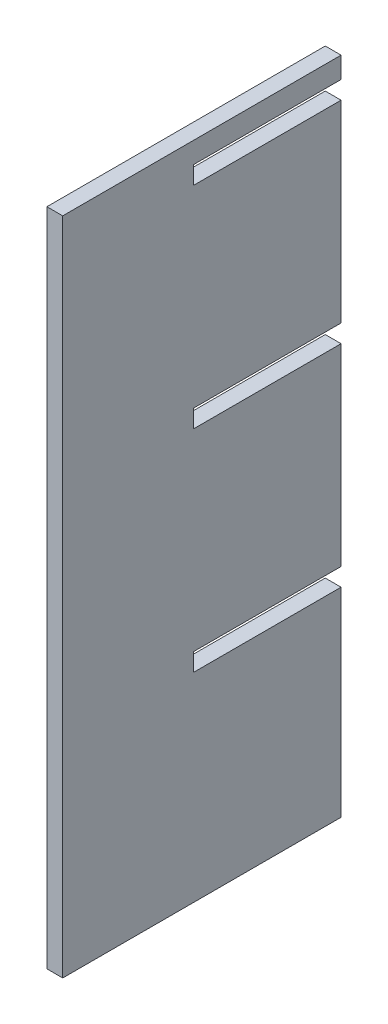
ISO-10303-21;
HEADER;
FILE_DESCRIPTION(('STEP AP214'),'2;1');
FILE_NAME('part.step','',(''),(''),'','','');
FILE_SCHEMA(('AUTOMOTIVE_DESIGN { 1 0 10303 214 1 1 1 1 }'));
ENDSEC;
DATA;
#1=APPLICATION_CONTEXT('core data for automotive mechanical design processes');
#2=APPLICATION_PROTOCOL_DEFINITION('international standard','automotive_design',2000,#1);
#3=PRODUCT_CONTEXT('',#1,'mechanical');
#4=PRODUCT('Part','Part','',(#3));
#5=PRODUCT_RELATED_PRODUCT_CATEGORY('part','',(#4));
#6=PRODUCT_DEFINITION_FORMATION('','',#4);
#7=PRODUCT_DEFINITION_CONTEXT('part definition',#1,'design');
#8=PRODUCT_DEFINITION('design','',#6,#7);
#9=PRODUCT_DEFINITION_SHAPE('','',#8);
#10=(LENGTH_UNIT() NAMED_UNIT(*) SI_UNIT(.MILLI.,.METRE.));
#11=(NAMED_UNIT(*) PLANE_ANGLE_UNIT() SI_UNIT($,.RADIAN.));
#12=(NAMED_UNIT(*) SI_UNIT($,.STERADIAN.) SOLID_ANGLE_UNIT());
#13=UNCERTAINTY_MEASURE_WITH_UNIT(LENGTH_MEASURE(1.E-05),#10,'distance_accuracy_value','');
#14=(GEOMETRIC_REPRESENTATION_CONTEXT(3) GLOBAL_UNCERTAINTY_ASSIGNED_CONTEXT((#13)) GLOBAL_UNIT_ASSIGNED_CONTEXT((#10,
#11,#12)) REPRESENTATION_CONTEXT('',''));
#15=CARTESIAN_POINT('',(0.,0.,0.));
#16=DIRECTION('',(0.,0.,1.));
#17=DIRECTION('',(1.,0.,0.));
#18=AXIS2_PLACEMENT_3D('',#15,#16,#17);
#19=CARTESIAN_POINT('',(0.,0.,0.));
#20=DIRECTION('',(0.,0.,-1.));
#21=DIRECTION('',(-1.,0.,0.));
#22=AXIS2_PLACEMENT_3D('',#19,#20,#21);
#23=PLANE('',#22);
#24=DIRECTION('',(1.,0.,0.));
#25=VECTOR('',#24,1.);
#26=CARTESIAN_POINT('',(-32.352836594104,19.15,0.));
#27=LINE('',#26,#25);
#28=CARTESIAN_POINT('',(-18.25,19.15,0.));
#29=VERTEX_POINT('',#28);
#30=CARTESIAN_POINT('',(-16.75,19.15,0.));
#31=VERTEX_POINT('',#30);
#32=EDGE_CURVE('E199',#29,#31,#27,.T.);
#33=ORIENTED_EDGE('',*,*,#32,.T.);
#34=DIRECTION('',(0.,1.,0.));
#35=VECTOR('',#34,1.);
#36=CARTESIAN_POINT('',(-16.75,-39.75,0.));
#37=LINE('',#36,#35);
#38=CARTESIAN_POINT('',(-16.75,0.849999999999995,0.));
#39=VERTEX_POINT('',#38);
#40=EDGE_CURVE('E184',#39,#31,#37,.T.);
#41=ORIENTED_EDGE('',*,*,#40,.F.);
#42=DIRECTION('',(1.,0.,0.));
#43=VECTOR('',#42,1.);
#44=CARTESIAN_POINT('',(-32.352836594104,0.849999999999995,0.));
#45=LINE('',#44,#43);
#46=CARTESIAN_POINT('',(-18.25,0.849999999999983,0.));
#47=VERTEX_POINT('',#46);
#48=EDGE_CURVE('E198',#47,#39,#45,.T.);
#49=ORIENTED_EDGE('',*,*,#48,.F.);
#50=DIRECTION('',(0.,-1.,0.));
#51=VECTOR('',#50,1.);
#52=CARTESIAN_POINT('',(-18.25,-39.75,0.));
#53=LINE('',#52,#51);
#54=EDGE_CURVE('E175',#29,#47,#53,.T.);
#55=ORIENTED_EDGE('',*,*,#54,.F.);
#56=EDGE_LOOP('',(#33,#41,#49,#55));
#57=FACE_BOUND('',#56,.T.);
#58=ADVANCED_FACE('F33',(#57),#23,.T.);
#59=DIRECTION('',(1.,0.,0.));
#60=VECTOR('',#59,1.);
#61=CARTESIAN_POINT('',(-32.352836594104,-0.850000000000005,0.));
#62=LINE('',#61,#60);
#63=CARTESIAN_POINT('',(-18.25,-0.850000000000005,0.));
#64=VERTEX_POINT('',#63);
#65=CARTESIAN_POINT('',(-16.75,-0.850000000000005,0.));
#66=VERTEX_POINT('',#65);
#67=EDGE_CURVE('E220',#64,#66,#62,.T.);
#68=ORIENTED_EDGE('',*,*,#67,.T.);
#69=CARTESIAN_POINT('',(-16.75,-19.15,0.));
#70=VERTEX_POINT('',#69);
#71=EDGE_CURVE('E180',#70,#66,#37,.T.);
#72=ORIENTED_EDGE('',*,*,#71,.F.);
#73=DIRECTION('',(1.,0.,0.));
#74=VECTOR('',#73,1.);
#75=CARTESIAN_POINT('',(-32.352836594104,-19.15,0.));
#76=LINE('',#75,#74);
#77=CARTESIAN_POINT('',(-18.25,-19.15,0.));
#78=VERTEX_POINT('',#77);
#79=EDGE_CURVE('E252',#78,#70,#76,.T.);
#80=ORIENTED_EDGE('',*,*,#79,.F.);
#81=EDGE_CURVE('E265',#64,#78,#53,.T.);
#82=ORIENTED_EDGE('',*,*,#81,.F.);
#83=EDGE_LOOP('',(#68,#72,#80,#82));
#84=FACE_BOUND('',#83,.T.);
#85=ADVANCED_FACE('F284',(#84),#23,.T.);
#86=DIRECTION('',(1.,0.,0.));
#87=VECTOR('',#86,1.);
#88=CARTESIAN_POINT('',(-32.352836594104,-20.85,0.));
#89=LINE('',#88,#87);
#90=CARTESIAN_POINT('',(-18.25,-20.85,0.));
#91=VERTEX_POINT('',#90);
#92=CARTESIAN_POINT('',(-16.75,-20.85,0.));
#93=VERTEX_POINT('',#92);
#94=EDGE_CURVE('E242',#91,#93,#89,.T.);
#95=ORIENTED_EDGE('',*,*,#94,.T.);
#96=CARTESIAN_POINT('',(-16.75,-39.75,0.));
#97=VERTEX_POINT('',#96);
#98=EDGE_CURVE('E178',#97,#93,#37,.T.);
#99=ORIENTED_EDGE('',*,*,#98,.F.);
#100=DIRECTION('',(1.,0.,0.));
#101=VECTOR('',#100,1.);
#102=CARTESIAN_POINT('',(-18.25,-39.75,0.));
#103=LINE('',#102,#101);
#104=CARTESIAN_POINT('',(-18.25,-39.75,0.));
#105=VERTEX_POINT('',#104);
#106=EDGE_CURVE('E174',#105,#97,#103,.T.);
#107=ORIENTED_EDGE('',*,*,#106,.F.);
#108=EDGE_CURVE('E176',#91,#105,#53,.T.);
#109=ORIENTED_EDGE('',*,*,#108,.F.);
#110=EDGE_LOOP('',(#95,#99,#107,#109));
#111=FACE_BOUND('',#110,.T.);
#112=ADVANCED_FACE('F295',(#111),#23,.T.);
#113=CARTESIAN_POINT('',(-18.25,-39.75,26.4));
#114=DIRECTION('',(1.,0.,0.));
#115=DIRECTION('',(0.,0.,-1.));
#116=AXIS2_PLACEMENT_3D('',#113,#114,#115);
#117=PLANE('',#116);
#118=DIRECTION('',(0.,-1.,0.));
#119=VECTOR('',#118,1.);
#120=CARTESIAN_POINT('',(-18.25,-39.75,26.4));
#121=LINE('',#120,#119);
#122=CARTESIAN_POINT('',(-18.25,22.85,26.4));
#123=VERTEX_POINT('',#122);
#124=CARTESIAN_POINT('',(-18.25,-39.75,26.4));
#125=VERTEX_POINT('',#124);
#126=EDGE_CURVE('E169',#123,#125,#121,.T.);
#127=ORIENTED_EDGE('',*,*,#126,.F.);
#128=DIRECTION('',(0.,0.,1.));
#129=VECTOR('',#128,1.);
#130=CARTESIAN_POINT('',(-18.25,22.85,0.));
#131=LINE('',#130,#129);
#132=CARTESIAN_POINT('',(-18.25,22.85,0.));
#133=VERTEX_POINT('',#132);
#134=EDGE_CURVE('E148',#133,#123,#131,.T.);
#135=ORIENTED_EDGE('',*,*,#134,.F.);
#136=CARTESIAN_POINT('',(-18.25,20.85,0.));
#137=VERTEX_POINT('',#136);
#138=EDGE_CURVE('E56',#133,#137,#53,.T.);
#139=ORIENTED_EDGE('',*,*,#138,.T.);
#140=DIRECTION('',(0.,0.,-1.));
#141=VECTOR('',#140,1.);
#142=CARTESIAN_POINT('',(-18.25,20.85,0.));
#143=LINE('',#142,#141);
#144=CARTESIAN_POINT('',(-18.25,20.85,14.));
#145=VERTEX_POINT('',#144);
#146=EDGE_CURVE('E215',#145,#137,#143,.T.);
#147=ORIENTED_EDGE('',*,*,#146,.F.);
#148=DIRECTION('',(0.,1.,0.));
#149=VECTOR('',#148,1.);
#150=CARTESIAN_POINT('',(-18.25,19.15,14.));
#151=LINE('',#150,#149);
#152=CARTESIAN_POINT('',(-18.25,19.15,14.));
#153=VERTEX_POINT('',#152);
#154=EDGE_CURVE('E202',#153,#145,#151,.T.);
#155=ORIENTED_EDGE('',*,*,#154,.F.);
#156=DIRECTION('',(0.,0.,1.));
#157=VECTOR('',#156,1.);
#158=CARTESIAN_POINT('',(-18.25,19.15,0.));
#159=LINE('',#158,#157);
#160=EDGE_CURVE('E205',#29,#153,#159,.T.);
#161=ORIENTED_EDGE('',*,*,#160,.F.);
#162=ORIENTED_EDGE('',*,*,#54,.T.);
#163=DIRECTION('',(0.,0.,-1.));
#164=VECTOR('',#163,1.);
#165=CARTESIAN_POINT('',(-18.25,0.849999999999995,0.));
#166=LINE('',#165,#164);
#167=CARTESIAN_POINT('',(-18.25,0.849999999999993,14.));
#168=VERTEX_POINT('',#167);
#169=EDGE_CURVE('E222',#168,#47,#166,.T.);
#170=ORIENTED_EDGE('',*,*,#169,.F.);
#171=DIRECTION('',(0.,1.,0.));
#172=VECTOR('',#171,1.);
#173=CARTESIAN_POINT('',(-18.25,-0.850000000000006,14.));
#174=LINE('',#173,#172);
#175=CARTESIAN_POINT('',(-18.25,-0.850000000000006,14.));
#176=VERTEX_POINT('',#175);
#177=EDGE_CURVE('E217',#176,#168,#174,.T.);
#178=ORIENTED_EDGE('',*,*,#177,.F.);
#179=DIRECTION('',(0.,0.,1.));
#180=VECTOR('',#179,1.);
#181=CARTESIAN_POINT('',(-18.25,-0.850000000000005,0.));
#182=LINE('',#181,#180);
#183=EDGE_CURVE('E219',#64,#176,#182,.T.);
#184=ORIENTED_EDGE('',*,*,#183,.F.);
#185=ORIENTED_EDGE('',*,*,#81,.T.);
#186=DIRECTION('',(0.,0.,-1.));
#187=VECTOR('',#186,1.);
#188=CARTESIAN_POINT('',(-18.25,-19.15,0.));
#189=LINE('',#188,#187);
#190=CARTESIAN_POINT('',(-18.25,-19.15,14.));
#191=VERTEX_POINT('',#190);
#192=EDGE_CURVE('E244',#191,#78,#189,.T.);
#193=ORIENTED_EDGE('',*,*,#192,.F.);
#194=DIRECTION('',(0.,1.,0.));
#195=VECTOR('',#194,1.);
#196=CARTESIAN_POINT('',(-18.25,-20.85,14.));
#197=LINE('',#196,#195);
#198=CARTESIAN_POINT('',(-18.25,-20.85,14.));
#199=VERTEX_POINT('',#198);
#200=EDGE_CURVE('E239',#199,#191,#197,.T.);
#201=ORIENTED_EDGE('',*,*,#200,.F.);
#202=DIRECTION('',(0.,0.,1.));
#203=VECTOR('',#202,1.);
#204=CARTESIAN_POINT('',(-18.25,-20.85,0.));
#205=LINE('',#204,#203);
#206=EDGE_CURVE('E241',#91,#199,#205,.T.);
#207=ORIENTED_EDGE('',*,*,#206,.F.);
#208=ORIENTED_EDGE('',*,*,#108,.T.);
#209=DIRECTION('',(0.,0.,-1.));
#210=VECTOR('',#209,1.);
#211=CARTESIAN_POINT('',(-18.25,-39.75,26.4));
#212=LINE('',#211,#210);
#213=EDGE_CURVE('E11',#125,#105,#212,.T.);
#214=ORIENTED_EDGE('',*,*,#213,.F.);
#215=EDGE_LOOP('',(#127,#135,#139,#147,#155,#161,#162,#170,#178,#184,#185,#193,#201,#207,#208,#214));
#216=FACE_BOUND('',#215,.T.);
#217=ADVANCED_FACE('F35',(#216),#117,.F.);
#218=CARTESIAN_POINT('',(-18.25,-39.75,26.4));
#219=DIRECTION('',(0.,1.,0.));
#220=DIRECTION('',(0.,0.,1.));
#221=AXIS2_PLACEMENT_3D('',#218,#219,#220);
#222=PLANE('',#221);
#223=ORIENTED_EDGE('',*,*,#106,.T.);
#224=DIRECTION('',(0.,0.,-1.));
#225=VECTOR('',#224,1.);
#226=CARTESIAN_POINT('',(-16.75,-39.75,26.4));
#227=LINE('',#226,#225);
#228=CARTESIAN_POINT('',(-16.75,-39.75,26.4));
#229=VERTEX_POINT('',#228);
#230=EDGE_CURVE('E41',#229,#97,#227,.T.);
#231=ORIENTED_EDGE('',*,*,#230,.F.);
#232=DIRECTION('',(1.,0.,0.));
#233=VECTOR('',#232,1.);
#234=CARTESIAN_POINT('',(-18.25,-39.75,26.4));
#235=LINE('',#234,#233);
#236=EDGE_CURVE('E166',#125,#229,#235,.T.);
#237=ORIENTED_EDGE('',*,*,#236,.F.);
#238=ORIENTED_EDGE('',*,*,#213,.T.);
#239=EDGE_LOOP('',(#223,#231,#237,#238));
#240=FACE_BOUND('',#239,.T.);
#241=ADVANCED_FACE('F297',(#240),#222,.F.);
#242=CARTESIAN_POINT('',(-16.75,-39.75,26.4));
#243=DIRECTION('',(-1.,0.,0.));
#244=DIRECTION('',(0.,0.,1.));
#245=AXIS2_PLACEMENT_3D('',#242,#243,#244);
#246=PLANE('',#245);
#247=CARTESIAN_POINT('',(-16.75,20.85,0.));
#248=VERTEX_POINT('',#247);
#249=CARTESIAN_POINT('',(-16.75,22.85,0.));
#250=VERTEX_POINT('',#249);
#251=EDGE_CURVE('E162',#248,#250,#37,.T.);
#252=ORIENTED_EDGE('',*,*,#251,.T.);
#253=DIRECTION('',(0.,0.,-1.));
#254=VECTOR('',#253,1.);
#255=CARTESIAN_POINT('',(-16.75,22.85,0.));
#256=LINE('',#255,#254);
#257=CARTESIAN_POINT('',(-16.75,22.85,26.4));
#258=VERTEX_POINT('',#257);
#259=EDGE_CURVE('E48',#258,#250,#256,.T.);
#260=ORIENTED_EDGE('',*,*,#259,.F.);
#261=DIRECTION('',(0.,1.,0.));
#262=VECTOR('',#261,1.);
#263=CARTESIAN_POINT('',(-16.75,-39.75,26.4));
#264=LINE('',#263,#262);
#265=EDGE_CURVE('E159',#229,#258,#264,.T.);
#266=ORIENTED_EDGE('',*,*,#265,.F.);
#267=ORIENTED_EDGE('',*,*,#230,.T.);
#268=ORIENTED_EDGE('',*,*,#98,.T.);
#269=DIRECTION('',(0.,0.,-1.));
#270=VECTOR('',#269,1.);
#271=CARTESIAN_POINT('',(-16.75,-20.85,0.));
#272=LINE('',#271,#270);
#273=CARTESIAN_POINT('',(-16.75,-20.85,14.));
#274=VERTEX_POINT('',#273);
#275=EDGE_CURVE('E250',#274,#93,#272,.T.);
#276=ORIENTED_EDGE('',*,*,#275,.F.);
#277=DIRECTION('',(0.,-1.,0.));
#278=VECTOR('',#277,1.);
#279=CARTESIAN_POINT('',(-16.75,-20.85,14.));
#280=LINE('',#279,#278);
#281=CARTESIAN_POINT('',(-16.75,-19.15,14.));
#282=VERTEX_POINT('',#281);
#283=EDGE_CURVE('E247',#282,#274,#280,.T.);
#284=ORIENTED_EDGE('',*,*,#283,.F.);
#285=DIRECTION('',(0.,0.,1.));
#286=VECTOR('',#285,1.);
#287=CARTESIAN_POINT('',(-16.75,-19.15,0.));
#288=LINE('',#287,#286);
#289=EDGE_CURVE('E238',#70,#282,#288,.T.);
#290=ORIENTED_EDGE('',*,*,#289,.F.);
#291=ORIENTED_EDGE('',*,*,#71,.T.);
#292=DIRECTION('',(0.,0.,-1.));
#293=VECTOR('',#292,1.);
#294=CARTESIAN_POINT('',(-16.75,-0.850000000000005,0.));
#295=LINE('',#294,#293);
#296=CARTESIAN_POINT('',(-16.75,-0.850000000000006,14.));
#297=VERTEX_POINT('',#296);
#298=EDGE_CURVE('E227',#297,#66,#295,.T.);
#299=ORIENTED_EDGE('',*,*,#298,.F.);
#300=DIRECTION('',(0.,-1.,0.));
#301=VECTOR('',#300,1.);
#302=CARTESIAN_POINT('',(-16.75,-0.850000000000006,14.));
#303=LINE('',#302,#301);
#304=CARTESIAN_POINT('',(-16.75,0.849999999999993,14.));
#305=VERTEX_POINT('',#304);
#306=EDGE_CURVE('E224',#305,#297,#303,.T.);
#307=ORIENTED_EDGE('',*,*,#306,.F.);
#308=DIRECTION('',(0.,0.,1.));
#309=VECTOR('',#308,1.);
#310=CARTESIAN_POINT('',(-16.75,0.849999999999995,0.));
#311=LINE('',#310,#309);
#312=EDGE_CURVE('E193',#39,#305,#311,.T.);
#313=ORIENTED_EDGE('',*,*,#312,.F.);
#314=ORIENTED_EDGE('',*,*,#40,.T.);
#315=DIRECTION('',(0.,0.,-1.));
#316=VECTOR('',#315,1.);
#317=CARTESIAN_POINT('',(-16.75,19.15,0.));
#318=LINE('',#317,#316);
#319=CARTESIAN_POINT('',(-16.75,19.15,14.));
#320=VERTEX_POINT('',#319);
#321=EDGE_CURVE('E190',#320,#31,#318,.T.);
#322=ORIENTED_EDGE('',*,*,#321,.F.);
#323=DIRECTION('',(0.,-1.,0.));
#324=VECTOR('',#323,1.);
#325=CARTESIAN_POINT('',(-16.75,19.15,14.));
#326=LINE('',#325,#324);
#327=CARTESIAN_POINT('',(-16.75,20.85,14.));
#328=VERTEX_POINT('',#327);
#329=EDGE_CURVE('E308',#328,#320,#326,.T.);
#330=ORIENTED_EDGE('',*,*,#329,.F.);
#331=DIRECTION('',(0.,0.,1.));
#332=VECTOR('',#331,1.);
#333=CARTESIAN_POINT('',(-16.75,20.85,0.));
#334=LINE('',#333,#332);
#335=EDGE_CURVE('E298',#248,#328,#334,.T.);
#336=ORIENTED_EDGE('',*,*,#335,.F.);
#337=EDGE_LOOP('',(#252,#260,#266,#267,#268,#276,#284,#290,#291,#299,#307,#313,#314,#322,#330,#336));
#338=FACE_BOUND('',#337,.T.);
#339=ADVANCED_FACE('F157',(#338),#246,.F.);
#340=CARTESIAN_POINT('',(0.,0.,26.4));
#341=DIRECTION('',(0.,0.,-1.));
#342=DIRECTION('',(-1.,0.,0.));
#343=AXIS2_PLACEMENT_3D('',#340,#341,#342);
#344=PLANE('',#343);
#345=ORIENTED_EDGE('',*,*,#265,.T.);
#346=DIRECTION('',(1.,0.,0.));
#347=VECTOR('',#346,1.);
#348=CARTESIAN_POINT('',(-49.5959726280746,22.85,26.4));
#349=LINE('',#348,#347);
#350=EDGE_CURVE('E146',#123,#258,#349,.T.);
#351=ORIENTED_EDGE('',*,*,#350,.F.);
#352=ORIENTED_EDGE('',*,*,#126,.T.);
#353=ORIENTED_EDGE('',*,*,#236,.T.);
#354=EDGE_LOOP('',(#345,#351,#352,#353));
#355=FACE_BOUND('',#354,.T.);
#356=ADVANCED_FACE('F164',(#355),#344,.F.);
#357=DIRECTION('',(1.,0.,0.));
#358=VECTOR('',#357,1.);
#359=CARTESIAN_POINT('',(-49.5959726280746,22.85,0.));
#360=LINE('',#359,#358);
#361=EDGE_CURVE('E152',#133,#250,#360,.T.);
#362=ORIENTED_EDGE('',*,*,#361,.T.);
#363=ORIENTED_EDGE('',*,*,#251,.F.);
#364=DIRECTION('',(1.,0.,0.));
#365=VECTOR('',#364,1.);
#366=CARTESIAN_POINT('',(-32.352836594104,20.85,0.));
#367=LINE('',#366,#365);
#368=EDGE_CURVE('E213',#137,#248,#367,.T.);
#369=ORIENTED_EDGE('',*,*,#368,.F.);
#370=ORIENTED_EDGE('',*,*,#138,.F.);
#371=EDGE_LOOP('',(#362,#363,#369,#370));
#372=FACE_BOUND('',#371,.T.);
#373=ADVANCED_FACE('F302',(#372),#23,.T.);
#374=CARTESIAN_POINT('',(-32.352836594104,-20.85,0.));
#375=DIRECTION('',(0.,-1.,0.));
#376=DIRECTION('',(0.,0.,-1.));
#377=AXIS2_PLACEMENT_3D('',#374,#375,#376);
#378=PLANE('',#377);
#379=ORIENTED_EDGE('',*,*,#206,.T.);
#380=DIRECTION('',(1.,0.,0.));
#381=VECTOR('',#380,1.);
#382=CARTESIAN_POINT('',(-32.352836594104,-20.85,14.));
#383=LINE('',#382,#381);
#384=EDGE_CURVE('E255',#199,#274,#383,.T.);
#385=ORIENTED_EDGE('',*,*,#384,.T.);
#386=ORIENTED_EDGE('',*,*,#275,.T.);
#387=ORIENTED_EDGE('',*,*,#94,.F.);
#388=EDGE_LOOP('',(#379,#385,#386,#387));
#389=FACE_BOUND('',#388,.T.);
#390=ADVANCED_FACE('F332',(#389),#378,.F.);
#391=CARTESIAN_POINT('',(-32.352836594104,-20.85,14.));
#392=DIRECTION('',(0.,0.,1.));
#393=DIRECTION('',(1.,0.,0.));
#394=AXIS2_PLACEMENT_3D('',#391,#392,#393);
#395=PLANE('',#394);
#396=ORIENTED_EDGE('',*,*,#200,.T.);
#397=DIRECTION('',(1.,0.,0.));
#398=VECTOR('',#397,1.);
#399=CARTESIAN_POINT('',(-32.352836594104,-19.15,14.));
#400=LINE('',#399,#398);
#401=EDGE_CURVE('E257',#191,#282,#400,.T.);
#402=ORIENTED_EDGE('',*,*,#401,.T.);
#403=ORIENTED_EDGE('',*,*,#283,.T.);
#404=ORIENTED_EDGE('',*,*,#384,.F.);
#405=EDGE_LOOP('',(#396,#402,#403,#404));
#406=FACE_BOUND('',#405,.T.);
#407=ADVANCED_FACE('F291',(#406),#395,.F.);
#408=CARTESIAN_POINT('',(-32.352836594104,-19.15,0.));
#409=DIRECTION('',(0.,1.,0.));
#410=DIRECTION('',(0.,0.,1.));
#411=AXIS2_PLACEMENT_3D('',#408,#409,#410);
#412=PLANE('',#411);
#413=ORIENTED_EDGE('',*,*,#192,.T.);
#414=ORIENTED_EDGE('',*,*,#79,.T.);
#415=ORIENTED_EDGE('',*,*,#289,.T.);
#416=ORIENTED_EDGE('',*,*,#401,.F.);
#417=EDGE_LOOP('',(#413,#414,#415,#416));
#418=FACE_BOUND('',#417,.T.);
#419=ADVANCED_FACE('F287',(#418),#412,.F.);
#420=CARTESIAN_POINT('',(-32.352836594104,-0.850000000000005,0.));
#421=DIRECTION('',(0.,-1.,0.));
#422=DIRECTION('',(0.,0.,-1.));
#423=AXIS2_PLACEMENT_3D('',#420,#421,#422);
#424=PLANE('',#423);
#425=ORIENTED_EDGE('',*,*,#183,.T.);
#426=DIRECTION('',(1.,0.,0.));
#427=VECTOR('',#426,1.);
#428=CARTESIAN_POINT('',(-32.352836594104,-0.850000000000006,14.));
#429=LINE('',#428,#427);
#430=EDGE_CURVE('E231',#176,#297,#429,.T.);
#431=ORIENTED_EDGE('',*,*,#430,.T.);
#432=ORIENTED_EDGE('',*,*,#298,.T.);
#433=ORIENTED_EDGE('',*,*,#67,.F.);
#434=EDGE_LOOP('',(#425,#431,#432,#433));
#435=FACE_BOUND('',#434,.T.);
#436=ADVANCED_FACE('F422',(#435),#424,.F.);
#437=CARTESIAN_POINT('',(-32.352836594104,-0.850000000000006,14.));
#438=DIRECTION('',(0.,0.,1.));
#439=DIRECTION('',(1.,0.,0.));
#440=AXIS2_PLACEMENT_3D('',#437,#438,#439);
#441=PLANE('',#440);
#442=ORIENTED_EDGE('',*,*,#177,.T.);
#443=DIRECTION('',(1.,0.,0.));
#444=VECTOR('',#443,1.);
#445=CARTESIAN_POINT('',(-32.352836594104,0.849999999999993,14.));
#446=LINE('',#445,#444);
#447=EDGE_CURVE('E233',#168,#305,#446,.T.);
#448=ORIENTED_EDGE('',*,*,#447,.T.);
#449=ORIENTED_EDGE('',*,*,#306,.T.);
#450=ORIENTED_EDGE('',*,*,#430,.F.);
#451=EDGE_LOOP('',(#442,#448,#449,#450));
#452=FACE_BOUND('',#451,.T.);
#453=ADVANCED_FACE('F279',(#452),#441,.F.);
#454=CARTESIAN_POINT('',(-32.352836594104,0.849999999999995,0.));
#455=DIRECTION('',(0.,1.,0.));
#456=DIRECTION('',(0.,0.,1.));
#457=AXIS2_PLACEMENT_3D('',#454,#455,#456);
#458=PLANE('',#457);
#459=ORIENTED_EDGE('',*,*,#169,.T.);
#460=ORIENTED_EDGE('',*,*,#48,.T.);
#461=ORIENTED_EDGE('',*,*,#312,.T.);
#462=ORIENTED_EDGE('',*,*,#447,.F.);
#463=EDGE_LOOP('',(#459,#460,#461,#462));
#464=FACE_BOUND('',#463,.T.);
#465=ADVANCED_FACE('F277',(#464),#458,.F.);
#466=CARTESIAN_POINT('',(-32.352836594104,19.15,0.));
#467=DIRECTION('',(0.,-1.,0.));
#468=DIRECTION('',(0.,0.,-1.));
#469=AXIS2_PLACEMENT_3D('',#466,#467,#468);
#470=PLANE('',#469);
#471=ORIENTED_EDGE('',*,*,#160,.T.);
#472=DIRECTION('',(1.,0.,0.));
#473=VECTOR('',#472,1.);
#474=CARTESIAN_POINT('',(-32.352836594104,19.15,14.));
#475=LINE('',#474,#473);
#476=EDGE_CURVE('E203',#153,#320,#475,.T.);
#477=ORIENTED_EDGE('',*,*,#476,.T.);
#478=ORIENTED_EDGE('',*,*,#321,.T.);
#479=ORIENTED_EDGE('',*,*,#32,.F.);
#480=EDGE_LOOP('',(#471,#477,#478,#479));
#481=FACE_BOUND('',#480,.T.);
#482=ADVANCED_FACE('F313',(#481),#470,.F.);
#483=CARTESIAN_POINT('',(-32.352836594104,19.15,14.));
#484=DIRECTION('',(0.,0.,1.));
#485=DIRECTION('',(1.,0.,0.));
#486=AXIS2_PLACEMENT_3D('',#483,#484,#485);
#487=PLANE('',#486);
#488=ORIENTED_EDGE('',*,*,#154,.T.);
#489=DIRECTION('',(1.,0.,0.));
#490=VECTOR('',#489,1.);
#491=CARTESIAN_POINT('',(-32.352836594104,20.85,14.));
#492=LINE('',#491,#490);
#493=EDGE_CURVE('E207',#145,#328,#492,.T.);
#494=ORIENTED_EDGE('',*,*,#493,.T.);
#495=ORIENTED_EDGE('',*,*,#329,.T.);
#496=ORIENTED_EDGE('',*,*,#476,.F.);
#497=EDGE_LOOP('',(#488,#494,#495,#496));
#498=FACE_BOUND('',#497,.T.);
#499=ADVANCED_FACE('F315',(#498),#487,.F.);
#500=CARTESIAN_POINT('',(-32.352836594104,20.85,0.));
#501=DIRECTION('',(0.,1.,0.));
#502=DIRECTION('',(0.,0.,1.));
#503=AXIS2_PLACEMENT_3D('',#500,#501,#502);
#504=PLANE('',#503);
#505=ORIENTED_EDGE('',*,*,#146,.T.);
#506=ORIENTED_EDGE('',*,*,#368,.T.);
#507=ORIENTED_EDGE('',*,*,#335,.T.);
#508=ORIENTED_EDGE('',*,*,#493,.F.);
#509=EDGE_LOOP('',(#505,#506,#507,#508));
#510=FACE_BOUND('',#509,.T.);
#511=ADVANCED_FACE('F305',(#510),#504,.F.);
#512=CARTESIAN_POINT('',(-49.5959726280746,22.85,0.));
#513=DIRECTION('',(0.,-1.,0.));
#514=DIRECTION('',(0.,0.,-1.));
#515=AXIS2_PLACEMENT_3D('',#512,#513,#514);
#516=PLANE('',#515);
#517=ORIENTED_EDGE('',*,*,#134,.T.);
#518=ORIENTED_EDGE('',*,*,#350,.T.);
#519=ORIENTED_EDGE('',*,*,#259,.T.);
#520=ORIENTED_EDGE('',*,*,#361,.F.);
#521=EDGE_LOOP('',(#517,#518,#519,#520));
#522=FACE_BOUND('',#521,.T.);
#523=ADVANCED_FACE('F147',(#522),#516,.F.);
#524=CLOSED_SHELL('',(#58,#85,#112,#217,#241,#339,#356,#373,#390,#407,#419,#436,#453,#465,#482,
#499,#511,#523));
#525=MANIFOLD_SOLID_BREP('B2',#524);
#526=ADVANCED_BREP_SHAPE_REPRESENTATION('',(#18,#525),#14);
#527=SHAPE_DEFINITION_REPRESENTATION(#9,#526);
ENDSEC;
END-ISO-10303-21;
